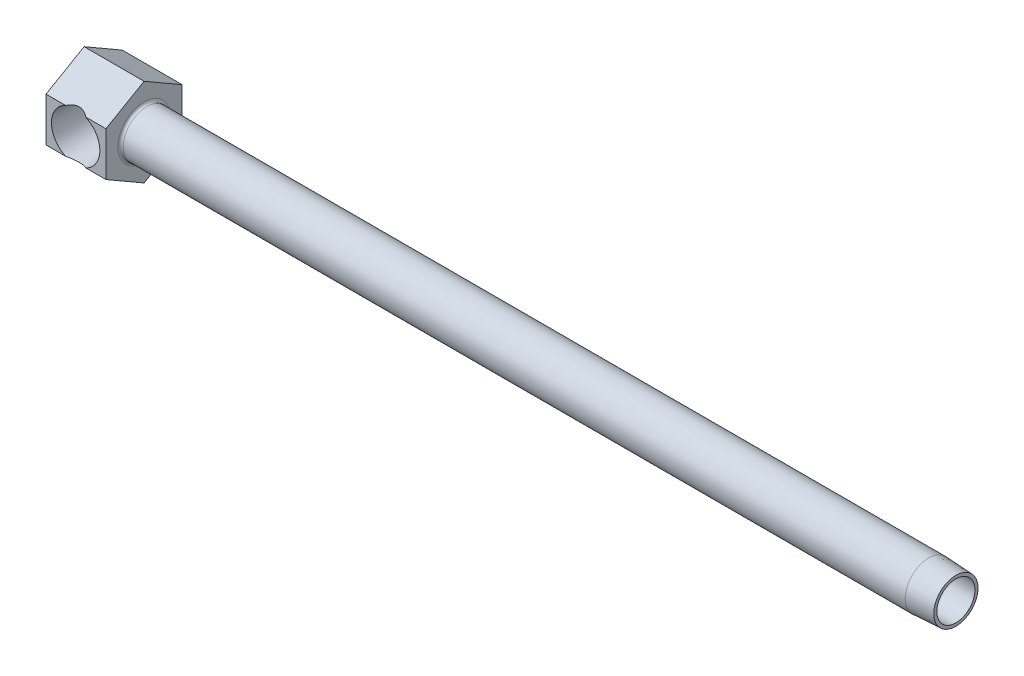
ISO-10303-21;
HEADER;
FILE_DESCRIPTION(('STEP AP214'),'2;1');
FILE_NAME('part.step','',(''),(''),'','','');
FILE_SCHEMA(('AUTOMOTIVE_DESIGN { 1 0 10303 214 1 1 1 1 }'));
ENDSEC;
DATA;
#1=APPLICATION_CONTEXT('core data for automotive mechanical design processes');
#2=APPLICATION_PROTOCOL_DEFINITION('international standard','automotive_design',2000,#1);
#3=PRODUCT_CONTEXT('',#1,'mechanical');
#4=PRODUCT('Part','Part','',(#3));
#5=PRODUCT_RELATED_PRODUCT_CATEGORY('part','',(#4));
#6=PRODUCT_DEFINITION_FORMATION('','',#4);
#7=PRODUCT_DEFINITION_CONTEXT('part definition',#1,'design');
#8=PRODUCT_DEFINITION('design','',#6,#7);
#9=PRODUCT_DEFINITION_SHAPE('','',#8);
#10=(LENGTH_UNIT() NAMED_UNIT(*) SI_UNIT(.MILLI.,.METRE.));
#11=(NAMED_UNIT(*) PLANE_ANGLE_UNIT() SI_UNIT($,.RADIAN.));
#12=(NAMED_UNIT(*) SI_UNIT($,.STERADIAN.) SOLID_ANGLE_UNIT());
#13=UNCERTAINTY_MEASURE_WITH_UNIT(LENGTH_MEASURE(1.E-05),#10,'distance_accuracy_value','');
#14=(GEOMETRIC_REPRESENTATION_CONTEXT(3) GLOBAL_UNCERTAINTY_ASSIGNED_CONTEXT((#13)) GLOBAL_UNIT_ASSIGNED_CONTEXT((#10,
#11,#12)) REPRESENTATION_CONTEXT('',''));
#15=CARTESIAN_POINT('',(0.,0.,0.));
#16=DIRECTION('',(0.,0.,1.));
#17=DIRECTION('',(1.,0.,0.));
#18=AXIS2_PLACEMENT_3D('',#15,#16,#17);
#19=CARTESIAN_POINT('',(63.5,0.,11.1125));
#20=DIRECTION('',(-1.,0.,0.));
#21=DIRECTION('',(0.,0.,1.));
#22=AXIS2_PLACEMENT_3D('',#19,#20,#21);
#23=CYLINDRICAL_SURFACE('',#22,6.858);
#24=CARTESIAN_POINT('',(18.2499,0.,11.1125));
#25=DIRECTION('',(-1.,0.,0.));
#26=DIRECTION('',(0.,-1.,0.));
#27=AXIS2_PLACEMENT_3D('',#24,#25,#26);
#28=CIRCLE('',#27,6.858);
#29=CARTESIAN_POINT('',(18.2499,-6.858,11.1125));
#30=VERTEX_POINT('',#29);
#31=EDGE_CURVE('E174',#30,#30,#28,.F.);
#32=ORIENTED_EDGE('',*,*,#31,.T.);
#33=EDGE_LOOP('',(#32));
#34=FACE_BOUND('',#33,.T.);
#35=CARTESIAN_POINT('',(246.0752,0.,11.1125));
#36=DIRECTION('',(1.,0.,0.));
#37=DIRECTION('',(0.,0.,-1.));
#38=AXIS2_PLACEMENT_3D('',#35,#36,#37);
#39=CIRCLE('',#38,6.858);
#40=CARTESIAN_POINT('',(246.0752,0.,4.2545));
#41=VERTEX_POINT('',#40);
#42=EDGE_CURVE('E218',#41,#41,#39,.T.);
#43=ORIENTED_EDGE('',*,*,#42,.F.);
#44=EDGE_LOOP('',(#43));
#45=FACE_BOUND('',#44,.T.);
#46=ADVANCED_FACE('F15',(#34,#45),#23,.T.);
#47=CARTESIAN_POINT('',(17.4625,6.4158048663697,22.225));
#48=DIRECTION('',(0.,0.,-1.));
#49=DIRECTION('',(0.,1.,0.));
#50=AXIS2_PLACEMENT_3D('',#47,#48,#49);
#51=PLANE('',#50);
#52=CARTESIAN_POINT('',(8.636,0.,22.225));
#53=DIRECTION('',(0.,0.,1.));
#54=DIRECTION('',(1.,0.,0.));
#55=AXIS2_PLACEMENT_3D('',#52,#53,#54);
#56=CIRCLE('',#55,7.05231);
#57=CARTESIAN_POINT('',(5.70811266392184,6.4158048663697,22.225));
#58=VERTEX_POINT('',#57);
#59=CARTESIAN_POINT('',(5.70811266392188,-6.41580486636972,22.225));
#60=VERTEX_POINT('',#59);
#61=EDGE_CURVE('E229',#58,#60,#56,.T.);
#62=ORIENTED_EDGE('',*,*,#61,.F.);
#63=DIRECTION('',(-1.,0.,0.));
#64=VECTOR('',#63,1.);
#65=CARTESIAN_POINT('',(17.4625,6.4158048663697,22.225));
#66=LINE('',#65,#64);
#67=CARTESIAN_POINT('',(0.,6.4158048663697,22.225));
#68=VERTEX_POINT('',#67);
#69=EDGE_CURVE('E158',#58,#68,#66,.T.);
#70=ORIENTED_EDGE('',*,*,#69,.T.);
#71=DIRECTION('',(0.,-1.,0.));
#72=VECTOR('',#71,1.);
#73=CARTESIAN_POINT('',(0.,6.4158048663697,22.225));
#74=LINE('',#73,#72);
#75=CARTESIAN_POINT('',(0.,-6.41580486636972,22.225));
#76=VERTEX_POINT('',#75);
#77=EDGE_CURVE('E128',#68,#76,#74,.T.);
#78=ORIENTED_EDGE('',*,*,#77,.T.);
#79=DIRECTION('',(-1.,0.,0.));
#80=VECTOR('',#79,1.);
#81=CARTESIAN_POINT('',(17.4625,-6.41580486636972,22.225));
#82=LINE('',#81,#80);
#83=EDGE_CURVE('E154',#60,#76,#82,.T.);
#84=ORIENTED_EDGE('',*,*,#83,.F.);
#85=EDGE_LOOP('',(#62,#70,#78,#84));
#86=FACE_BOUND('',#85,.T.);
#87=ADVANCED_FACE('F205',(#86),#51,.F.);
#88=CARTESIAN_POINT('',(11.5638873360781,-6.41580486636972,22.225));
#89=VERTEX_POINT('',#88);
#90=CARTESIAN_POINT('',(11.5638873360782,6.4158048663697,22.225));
#91=VERTEX_POINT('',#90);
#92=EDGE_CURVE('E228',#89,#91,#56,.T.);
#93=ORIENTED_EDGE('',*,*,#92,.F.);
#94=CARTESIAN_POINT('',(17.4625,-6.41580486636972,22.225));
#95=VERTEX_POINT('',#94);
#96=EDGE_CURVE('E155',#95,#89,#82,.T.);
#97=ORIENTED_EDGE('',*,*,#96,.F.);
#98=DIRECTION('',(0.,-1.,0.));
#99=VECTOR('',#98,1.);
#100=CARTESIAN_POINT('',(17.4625,6.4158048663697,22.225));
#101=LINE('',#100,#99);
#102=CARTESIAN_POINT('',(17.4625,6.4158048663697,22.225));
#103=VERTEX_POINT('',#102);
#104=EDGE_CURVE('E145',#103,#95,#101,.T.);
#105=ORIENTED_EDGE('',*,*,#104,.F.);
#106=EDGE_CURVE('E159',#103,#91,#66,.T.);
#107=ORIENTED_EDGE('',*,*,#106,.T.);
#108=EDGE_LOOP('',(#93,#97,#105,#107));
#109=FACE_BOUND('',#108,.T.);
#110=ADVANCED_FACE('F211',(#109),#51,.F.);
#111=CARTESIAN_POINT('',(17.4625,12.8316097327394,11.1125));
#112=DIRECTION('',(0.,-0.866025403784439,-0.5));
#113=DIRECTION('',(0.,0.5,-0.866025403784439));
#114=AXIS2_PLACEMENT_3D('',#111,#112,#113);
#115=PLANE('',#114);
#116=ORIENTED_EDGE('',*,*,#69,.F.);
#117=CARTESIAN_POINT('',(8.636,-0.384020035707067,34.002642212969));
#118=DIRECTION('',(0.,-0.866025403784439,-0.5));
#119=DIRECTION('',(0.,-0.5,0.866025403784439));
#120=AXIS2_PLACEMENT_3D('',#117,#118,#119);
#121=ELLIPSE('',#120,14.8098967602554,7.39498405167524);
#122=EDGE_CURVE('E109',#58,#91,#121,.T.);
#123=ORIENTED_EDGE('',*,*,#122,.T.);
#124=ORIENTED_EDGE('',*,*,#106,.F.);
#125=DIRECTION('',(0.,-0.5,0.866025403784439));
#126=VECTOR('',#125,1.);
#127=CARTESIAN_POINT('',(17.4625,12.8316097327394,11.1125));
#128=LINE('',#127,#126);
#129=CARTESIAN_POINT('',(17.4625,12.8316097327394,11.1125));
#130=VERTEX_POINT('',#129);
#131=EDGE_CURVE('E143',#130,#103,#128,.T.);
#132=ORIENTED_EDGE('',*,*,#131,.F.);
#133=DIRECTION('',(-1.,0.,0.));
#134=VECTOR('',#133,1.);
#135=CARTESIAN_POINT('',(17.4625,12.8316097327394,11.1125));
#136=LINE('',#135,#134);
#137=CARTESIAN_POINT('',(0.,12.8316097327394,11.1125));
#138=VERTEX_POINT('',#137);
#139=EDGE_CURVE('E162',#130,#138,#136,.T.);
#140=ORIENTED_EDGE('',*,*,#139,.T.);
#141=DIRECTION('',(0.,-0.5,0.866025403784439));
#142=VECTOR('',#141,1.);
#143=CARTESIAN_POINT('',(0.,12.8316097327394,11.1125));
#144=LINE('',#143,#142);
#145=EDGE_CURVE('E124',#138,#68,#144,.T.);
#146=ORIENTED_EDGE('',*,*,#145,.T.);
#147=EDGE_LOOP('',(#116,#123,#124,#132,#140,#146));
#148=FACE_BOUND('',#147,.T.);
#149=ADVANCED_FACE('F257',(#148),#115,.F.);
#150=CARTESIAN_POINT('',(17.4625,-6.41580486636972,22.225));
#151=DIRECTION('',(0.,0.866025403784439,-0.5));
#152=DIRECTION('',(0.,0.5,0.866025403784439));
#153=AXIS2_PLACEMENT_3D('',#150,#151,#152);
#154=PLANE('',#153);
#155=ORIENTED_EDGE('',*,*,#96,.T.);
#156=CARTESIAN_POINT('',(8.636,0.384020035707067,34.0026422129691));
#157=DIRECTION('',(0.,0.866025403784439,-0.5));
#158=DIRECTION('',(0.,0.5,0.866025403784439));
#159=AXIS2_PLACEMENT_3D('',#156,#157,#158);
#160=ELLIPSE('',#159,14.8098967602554,7.39498405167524);
#161=EDGE_CURVE('E34',#89,#60,#160,.T.);
#162=ORIENTED_EDGE('',*,*,#161,.T.);
#163=ORIENTED_EDGE('',*,*,#83,.T.);
#164=DIRECTION('',(0.,-0.5,-0.866025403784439));
#165=VECTOR('',#164,1.);
#166=CARTESIAN_POINT('',(0.,-6.41580486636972,22.225));
#167=LINE('',#166,#165);
#168=CARTESIAN_POINT('',(0.,-12.8316097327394,11.1125));
#169=VERTEX_POINT('',#168);
#170=EDGE_CURVE('E132',#76,#169,#167,.T.);
#171=ORIENTED_EDGE('',*,*,#170,.T.);
#172=DIRECTION('',(-1.,0.,0.));
#173=VECTOR('',#172,1.);
#174=CARTESIAN_POINT('',(17.4625,-12.8316097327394,11.1125));
#175=LINE('',#174,#173);
#176=CARTESIAN_POINT('',(17.4625,-12.8316097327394,11.1125));
#177=VERTEX_POINT('',#176);
#178=EDGE_CURVE('E149',#177,#169,#175,.T.);
#179=ORIENTED_EDGE('',*,*,#178,.F.);
#180=DIRECTION('',(0.,-0.5,-0.866025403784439));
#181=VECTOR('',#180,1.);
#182=CARTESIAN_POINT('',(17.4625,-6.41580486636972,22.225));
#183=LINE('',#182,#181);
#184=EDGE_CURVE('E147',#95,#177,#183,.T.);
#185=ORIENTED_EDGE('',*,*,#184,.F.);
#186=EDGE_LOOP('',(#155,#162,#163,#171,#179,#185));
#187=FACE_BOUND('',#186,.T.);
#188=ADVANCED_FACE('F235',(#187),#154,.F.);
#189=CARTESIAN_POINT('',(17.4625,-12.8316097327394,11.1125));
#190=DIRECTION('',(0.,0.866025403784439,0.5));
#191=DIRECTION('',(0.,-0.5,0.866025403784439));
#192=AXIS2_PLACEMENT_3D('',#189,#190,#191);
#193=PLANE('',#192);
#194=DIRECTION('',(0.,0.5,-0.866025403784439));
#195=VECTOR('',#194,1.);
#196=CARTESIAN_POINT('',(0.,-12.8316097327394,11.1125));
#197=LINE('',#196,#195);
#198=CARTESIAN_POINT('',(0.,-6.41580486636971,0.));
#199=VERTEX_POINT('',#198);
#200=EDGE_CURVE('E117',#169,#199,#197,.T.);
#201=ORIENTED_EDGE('',*,*,#200,.T.);
#202=DIRECTION('',(-1.,0.,0.));
#203=VECTOR('',#202,1.);
#204=CARTESIAN_POINT('',(17.4625,-6.41580486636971,0.));
#205=LINE('',#204,#203);
#206=CARTESIAN_POINT('',(17.4625,-6.41580486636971,0.));
#207=VERTEX_POINT('',#206);
#208=EDGE_CURVE('E168',#207,#199,#205,.T.);
#209=ORIENTED_EDGE('',*,*,#208,.F.);
#210=DIRECTION('',(0.,0.5,-0.866025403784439));
#211=VECTOR('',#210,1.);
#212=CARTESIAN_POINT('',(17.4625,-12.8316097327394,11.1125));
#213=LINE('',#212,#211);
#214=EDGE_CURVE('E135',#177,#207,#213,.T.);
#215=ORIENTED_EDGE('',*,*,#214,.F.);
#216=ORIENTED_EDGE('',*,*,#178,.T.);
#217=EDGE_LOOP('',(#201,#209,#215,#216));
#218=FACE_BOUND('',#217,.T.);
#219=ADVANCED_FACE('F247',(#218),#193,.F.);
#220=CARTESIAN_POINT('',(17.4625,-6.41580486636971,0.));
#221=DIRECTION('',(0.,0.,1.));
#222=DIRECTION('',(1.,0.,0.));
#223=AXIS2_PLACEMENT_3D('',#220,#221,#222);
#224=PLANE('',#223);
#225=DIRECTION('',(0.,1.,0.));
#226=VECTOR('',#225,1.);
#227=CARTESIAN_POINT('',(0.,-6.41580486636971,0.));
#228=LINE('',#227,#226);
#229=CARTESIAN_POINT('',(0.,6.41580486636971,0.));
#230=VERTEX_POINT('',#229);
#231=EDGE_CURVE('E118',#199,#230,#228,.T.);
#232=ORIENTED_EDGE('',*,*,#231,.T.);
#233=DIRECTION('',(-1.,0.,0.));
#234=VECTOR('',#233,1.);
#235=CARTESIAN_POINT('',(17.4625,6.41580486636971,0.));
#236=LINE('',#235,#234);
#237=CARTESIAN_POINT('',(17.4625,6.41580486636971,0.));
#238=VERTEX_POINT('',#237);
#239=EDGE_CURVE('E165',#238,#230,#236,.T.);
#240=ORIENTED_EDGE('',*,*,#239,.F.);
#241=DIRECTION('',(0.,1.,0.));
#242=VECTOR('',#241,1.);
#243=CARTESIAN_POINT('',(17.4625,-6.41580486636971,0.));
#244=LINE('',#243,#242);
#245=EDGE_CURVE('E139',#207,#238,#244,.T.);
#246=ORIENTED_EDGE('',*,*,#245,.F.);
#247=ORIENTED_EDGE('',*,*,#208,.T.);
#248=EDGE_LOOP('',(#232,#240,#246,#247));
#249=FACE_BOUND('',#248,.T.);
#250=ADVANCED_FACE('F264',(#249),#224,.F.);
#251=CARTESIAN_POINT('',(17.4625,6.4158048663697,0.));
#252=DIRECTION('',(0.,-0.866025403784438,0.5));
#253=DIRECTION('',(0.,-0.5,-0.866025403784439));
#254=AXIS2_PLACEMENT_3D('',#251,#252,#253);
#255=PLANE('',#254);
#256=DIRECTION('',(0.,0.5,0.866025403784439));
#257=VECTOR('',#256,1.);
#258=CARTESIAN_POINT('',(0.,6.4158048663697,0.));
#259=LINE('',#258,#257);
#260=EDGE_CURVE('E121',#230,#138,#259,.T.);
#261=ORIENTED_EDGE('',*,*,#260,.T.);
#262=ORIENTED_EDGE('',*,*,#139,.F.);
#263=DIRECTION('',(0.,0.5,0.866025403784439));
#264=VECTOR('',#263,1.);
#265=CARTESIAN_POINT('',(17.4625,6.4158048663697,0.));
#266=LINE('',#265,#264);
#267=EDGE_CURVE('E141',#238,#130,#266,.T.);
#268=ORIENTED_EDGE('',*,*,#267,.F.);
#269=ORIENTED_EDGE('',*,*,#239,.T.);
#270=EDGE_LOOP('',(#261,#262,#268,#269));
#271=FACE_BOUND('',#270,.T.);
#272=ADVANCED_FACE('F261',(#271),#255,.F.);
#273=CARTESIAN_POINT('',(17.4625,-19.2474145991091,22.225));
#274=DIRECTION('',(-1.,0.,0.));
#275=DIRECTION('',(0.,-1.,0.));
#276=AXIS2_PLACEMENT_3D('',#273,#274,#275);
#277=PLANE('',#276);
#278=CARTESIAN_POINT('',(17.4625,0.,11.1125));
#279=DIRECTION('',(-1.,0.,0.));
#280=DIRECTION('',(0.,-1.,0.));
#281=AXIS2_PLACEMENT_3D('',#278,#279,#280);
#282=CIRCLE('',#281,7.6454);
#283=CARTESIAN_POINT('',(17.4625,-7.6454,11.1125));
#284=VERTEX_POINT('',#283);
#285=EDGE_CURVE('E171',#284,#284,#282,.T.);
#286=ORIENTED_EDGE('',*,*,#285,.T.);
#287=EDGE_LOOP('',(#286));
#288=FACE_BOUND('',#287,.T.);
#289=ORIENTED_EDGE('',*,*,#214,.T.);
#290=ORIENTED_EDGE('',*,*,#245,.T.);
#291=ORIENTED_EDGE('',*,*,#267,.T.);
#292=ORIENTED_EDGE('',*,*,#131,.T.);
#293=ORIENTED_EDGE('',*,*,#104,.T.);
#294=ORIENTED_EDGE('',*,*,#184,.T.);
#295=EDGE_LOOP('',(#289,#290,#291,#292,#293,#294));
#296=FACE_BOUND('',#295,.T.);
#297=ADVANCED_FACE('F250',(#288,#296),#277,.F.);
#298=CARTESIAN_POINT('',(0.,-19.2474145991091,22.225));
#299=DIRECTION('',(-1.,0.,0.));
#300=DIRECTION('',(0.,-1.,0.));
#301=AXIS2_PLACEMENT_3D('',#298,#299,#300);
#302=PLANE('',#301);
#303=ORIENTED_EDGE('',*,*,#200,.F.);
#304=ORIENTED_EDGE('',*,*,#170,.F.);
#305=ORIENTED_EDGE('',*,*,#77,.F.);
#306=ORIENTED_EDGE('',*,*,#145,.F.);
#307=ORIENTED_EDGE('',*,*,#260,.F.);
#308=ORIENTED_EDGE('',*,*,#231,.F.);
#309=EDGE_LOOP('',(#303,#304,#305,#306,#307,#308));
#310=FACE_BOUND('',#309,.T.);
#311=ADVANCED_FACE('F243',(#310),#302,.T.);
#312=CARTESIAN_POINT('',(18.2499,0.,11.1125));
#313=DIRECTION('',(-1.,0.,0.));
#314=DIRECTION('',(0.,-1.,0.));
#315=AXIS2_PLACEMENT_3D('',#312,#313,#314);
#316=TOROIDAL_SURFACE('',#315,7.6454,0.7874);
#317=ORIENTED_EDGE('',*,*,#31,.F.);
#318=EDGE_LOOP('',(#317));
#319=FACE_BOUND('',#318,.T.);
#320=ORIENTED_EDGE('',*,*,#285,.F.);
#321=EDGE_LOOP('',(#320));
#322=FACE_BOUND('',#321,.T.);
#323=ADVANCED_FACE('F282',(#319,#322),#316,.F.);
#324=CARTESIAN_POINT('',(63.5,0.,11.1125));
#325=DIRECTION('',(1.,0.,0.));
#326=DIRECTION('',(0.,0.,-1.));
#327=AXIS2_PLACEMENT_3D('',#324,#325,#326);
#328=CYLINDRICAL_SURFACE('',#327,5.5499);
#329=DIRECTION('',(1.,0.,0.));
#330=VECTOR('',#329,1.);
#331=CARTESIAN_POINT('',(63.5,1.29165930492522,5.715));
#332=LINE('',#331,#330);
#333=CARTESIAN_POINT('',(15.0655177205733,1.29165930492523,5.715));
#334=VERTEX_POINT('',#333);
#335=CARTESIAN_POINT('',(14.0465577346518,1.29165930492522,5.715));
#336=VERTEX_POINT('',#335);
#337=EDGE_CURVE('E27',#334,#336,#332,.F.);
#338=ORIENTED_EDGE('',*,*,#337,.T.);
#339=CARTESIAN_POINT('',(14.0465577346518,1.29165930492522,5.715));
#340=CARTESIAN_POINT('',(14.0725617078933,1.1828202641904,5.68893317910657));
#341=CARTESIAN_POINT('',(14.0954190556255,1.0724477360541,5.66602138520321));
#342=CARTESIAN_POINT('',(14.1345363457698,0.849345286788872,5.62681178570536));
#343=CARTESIAN_POINT('',(14.1507939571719,0.736614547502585,5.61051631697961));
#344=CARTESIAN_POINT('',(14.1760383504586,0.512691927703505,5.58521342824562));
#345=CARTESIAN_POINT('',(14.1852120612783,0.401542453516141,5.57601863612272));
#346=CARTESIAN_POINT('',(14.1968530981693,0.17856718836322,5.56435088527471));
#347=CARTESIAN_POINT('',(14.1993222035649,0.0667415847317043,5.56187614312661));
#348=CARTESIAN_POINT('',(14.1975723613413,-0.14949882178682,5.56362999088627));
#349=CARTESIAN_POINT('',(14.193779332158,-0.253921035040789,5.56743168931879));
#350=CARTESIAN_POINT('',(14.1803598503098,-0.462026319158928,5.58088200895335));
#351=CARTESIAN_POINT('',(14.1707325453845,-0.565709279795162,5.59053148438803));
#352=CARTESIAN_POINT('',(14.1454600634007,-0.774399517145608,5.61586264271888));
#353=CARTESIAN_POINT('',(14.12966315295,-0.87936981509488,5.63169642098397));
#354=CARTESIAN_POINT('',(14.092340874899,-1.08722287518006,5.6691068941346));
#355=CARTESIAN_POINT('',(14.0708169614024,-1.1901061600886,5.69068213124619));
#356=CARTESIAN_POINT('',(14.0465577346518,-1.29165930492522,5.715));
#357=B_SPLINE_CURVE_WITH_KNOTS('',3,(#339,#340,#341,#342,#343,#344,#345,#346,#347,#348,#349,
#350,#351,#352,#353,#354,#355,#356),.UNSPECIFIED.,.F.,.F.,(4,2,2,2,2,2,2,2,4),(0.,
0.344637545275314,0.689396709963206,1.02471413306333,1.35994255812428,1.67329546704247,
1.98669416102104,2.30834220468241,2.62990865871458),.UNSPECIFIED.);
#358=CARTESIAN_POINT('',(14.0465577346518,-1.29165930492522,5.715));
#359=VERTEX_POINT('',#358);
#360=EDGE_CURVE('E10',#336,#359,#357,.T.);
#361=ORIENTED_EDGE('',*,*,#360,.T.);
#362=DIRECTION('',(1.,0.,0.));
#363=VECTOR('',#362,1.);
#364=CARTESIAN_POINT('',(63.5,-1.29165930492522,5.715));
#365=LINE('',#364,#363);
#366=CARTESIAN_POINT('',(15.0655177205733,-1.29165930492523,5.715));
#367=VERTEX_POINT('',#366);
#368=EDGE_CURVE('E184',#359,#367,#365,.T.);
#369=ORIENTED_EDGE('',*,*,#368,.T.);
#370=CARTESIAN_POINT('',(15.0656795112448,-1.29082327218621,5.71480000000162));
#371=CARTESIAN_POINT('',(15.0372536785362,-1.43791824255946,5.7499521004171));
#372=CARTESIAN_POINT('',(15.0041876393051,-1.58262926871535,5.79093746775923));
#373=CARTESIAN_POINT('',(14.9298152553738,-1.86616189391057,5.88364074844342));
#374=CARTESIAN_POINT('',(14.8885204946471,-2.00499144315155,5.93534357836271));
#375=CARTESIAN_POINT('',(14.7990709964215,-2.27477346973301,6.0481148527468));
#376=CARTESIAN_POINT('',(14.7509848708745,-2.40578805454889,6.10909004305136));
#377=CARTESIAN_POINT('',(14.6486806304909,-2.66083130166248,6.2399326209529));
#378=CARTESIAN_POINT('',(14.5944604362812,-2.78485757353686,6.30980302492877));
#379=CARTESIAN_POINT('',(14.4812536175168,-3.02482355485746,6.4572285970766));
#380=CARTESIAN_POINT('',(14.4222960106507,-3.1408054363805,6.53473755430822));
#381=CARTESIAN_POINT('',(14.3003856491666,-3.365215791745,6.6970845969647));
#382=CARTESIAN_POINT('',(14.2374332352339,-3.47364490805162,6.78192205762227));
#383=CARTESIAN_POINT('',(14.0435453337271,-3.78827180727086,7.04729631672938));
#384=CARTESIAN_POINT('',(13.9079456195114,-3.9830565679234,7.23822682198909));
#385=CARTESIAN_POINT('',(13.689310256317,-4.26816238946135,7.56146618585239));
#386=CARTESIAN_POINT('',(13.6074310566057,-4.3686517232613,7.68585924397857));
#387=CARTESIAN_POINT('',(13.4442899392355,-4.55879004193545,7.94320688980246));
#388=CARTESIAN_POINT('',(13.3630282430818,-4.6484352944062,8.07616440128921));
#389=CARTESIAN_POINT('',(13.2036424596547,-4.81645966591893,8.35044586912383));
#390=CARTESIAN_POINT('',(13.1255135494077,-4.89485662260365,8.49175606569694));
#391=CARTESIAN_POINT('',(12.9752684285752,-5.04004510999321,8.78316437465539));
#392=CARTESIAN_POINT('',(12.9031480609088,-5.10684469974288,8.93325628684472));
#393=CARTESIAN_POINT('',(12.757824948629,-5.23785122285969,9.26762207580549));
#394=CARTESIAN_POINT('',(12.686320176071,-5.29990617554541,9.45350692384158));
#395=CARTESIAN_POINT('',(12.5645322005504,-5.40502712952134,9.83721903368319));
#396=CARTESIAN_POINT('',(12.5142004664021,-5.44813656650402,10.035017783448));
#397=CARTESIAN_POINT('',(12.4606756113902,-5.49679755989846,10.3395644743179));
#398=CARTESIAN_POINT('',(12.4464754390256,-5.51038902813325,10.443158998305));
#399=CARTESIAN_POINT('',(12.4264834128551,-5.5317354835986,10.6517762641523));
#400=CARTESIAN_POINT('',(12.4206908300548,-5.53949097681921,10.7567988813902));
#401=CARTESIAN_POINT('',(12.4179376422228,-5.54899639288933,10.9671942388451));
#402=CARTESIAN_POINT('',(12.4209736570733,-5.55074861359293,11.0725668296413));
#403=CARTESIAN_POINT('',(12.4357182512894,-5.54828805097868,11.2826067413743));
#404=CARTESIAN_POINT('',(12.4474268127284,-5.54407527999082,11.3872740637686));
#405=CARTESIAN_POINT('',(12.4900727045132,-5.52483789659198,11.6684350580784));
#406=CARTESIAN_POINT('',(12.5287513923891,-5.5042766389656,11.8434168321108));
#407=CARTESIAN_POINT('',(12.6245766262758,-5.44793106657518,12.1856637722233));
#408=CARTESIAN_POINT('',(12.6817493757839,-5.41212512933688,12.3529176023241));
#409=CARTESIAN_POINT('',(12.8020710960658,-5.33165221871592,12.6608364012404));
#410=CARTESIAN_POINT('',(12.8638814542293,-5.28838367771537,12.8024081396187));
#411=CARTESIAN_POINT('',(12.9946271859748,-5.19196308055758,13.0788046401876));
#412=CARTESIAN_POINT('',(13.0635675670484,-5.13880405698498,13.2136245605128));
#413=CARTESIAN_POINT('',(13.2061680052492,-5.0230773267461,13.476991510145));
#414=CARTESIAN_POINT('',(13.2798387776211,-4.96048779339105,13.6055230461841));
#415=CARTESIAN_POINT('',(13.4297455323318,-4.82635797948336,13.8561944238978));
#416=CARTESIAN_POINT('',(13.505980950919,-4.75481965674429,13.9783356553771));
#417=CARTESIAN_POINT('',(13.664111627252,-4.59832635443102,14.2236446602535));
#418=CARTESIAN_POINT('',(13.7460684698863,-4.51281916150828,14.3464205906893));
#419=CARTESIAN_POINT('',(13.9094765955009,-4.33199713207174,14.5849036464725));
#420=CARTESIAN_POINT('',(13.9909278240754,-4.23668125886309,14.7006100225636));
#421=CARTESIAN_POINT('',(14.1517819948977,-4.03638256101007,14.9245234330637));
#422=CARTESIAN_POINT('',(14.231187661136,-3.93141354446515,15.0327408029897));
#423=CARTESIAN_POINT('',(14.3867175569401,-3.71172769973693,15.2413555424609));
#424=CARTESIAN_POINT('',(14.4628409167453,-3.59700831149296,15.3417508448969));
#425=CARTESIAN_POINT('',(14.668135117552,-3.26437402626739,15.6091426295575));
#426=CARTESIAN_POINT('',(14.7924014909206,-3.03572507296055,15.7670513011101));
#427=CARTESIAN_POINT('',(14.961823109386,-2.67104021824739,15.9794040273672));
#428=CARTESIAN_POINT('',(15.0154673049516,-2.54586009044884,16.0461031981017));
#429=CARTESIAN_POINT('',(15.1161712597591,-2.28856209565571,16.1705894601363));
#430=CARTESIAN_POINT('',(15.1632322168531,-2.15644549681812,16.2283781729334));
#431=CARTESIAN_POINT('',(15.2428146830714,-1.9076542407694,16.3256678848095));
#432=CARTESIAN_POINT('',(15.2764575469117,-1.79190088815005,16.3666154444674));
#433=CARTESIAN_POINT('',(15.3378292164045,-1.55651069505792,16.4410921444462));
#434=CARTESIAN_POINT('',(15.3655591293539,-1.43687458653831,16.4746226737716));
#435=CARTESIAN_POINT('',(15.4145953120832,-1.19439983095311,16.5337884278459));
#436=CARTESIAN_POINT('',(15.4359031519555,-1.0715619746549,16.5594255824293));
#437=CARTESIAN_POINT('',(15.4716760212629,-0.823504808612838,16.6024058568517));
#438=CARTESIAN_POINT('',(15.4861437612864,-0.698286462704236,16.6197522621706));
#439=CARTESIAN_POINT('',(15.5079865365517,-0.445852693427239,16.645922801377));
#440=CARTESIAN_POINT('',(15.5153340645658,-0.318631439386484,16.6547138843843));
#441=CARTESIAN_POINT('',(15.522677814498,-0.063671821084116,16.6635004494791));
#442=CARTESIAN_POINT('',(15.5226740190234,0.0640665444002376,16.6634959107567));
#443=CARTESIAN_POINT('',(15.5153149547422,0.319031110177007,16.6546910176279));
#444=CARTESIAN_POINT('',(15.5079593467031,0.446257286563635,16.64589025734));
#445=CARTESIAN_POINT('',(15.4860583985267,0.699182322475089,16.6196499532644));
#446=CARTESIAN_POINT('',(15.4715132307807,0.824881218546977,16.6022106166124));
#447=CARTESIAN_POINT('',(15.4365532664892,1.06681669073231,16.5602063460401));
#448=CARTESIAN_POINT('',(15.4165150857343,1.18318753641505,16.5360979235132));
#449=CARTESIAN_POINT('',(15.370668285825,1.41308832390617,16.4807930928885));
#450=CARTESIAN_POINT('',(15.3448577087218,1.52661728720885,16.4495942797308));
#451=CARTESIAN_POINT('',(15.2593968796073,1.8619852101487,16.3459550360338));
#452=CARTESIAN_POINT('',(15.1916934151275,2.07876635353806,16.2634431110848));
#453=CARTESIAN_POINT('',(15.0313088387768,2.51543897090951,16.0659794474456));
#454=CARTESIAN_POINT('',(14.9368359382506,2.73357267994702,15.9486491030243));
#455=CARTESIAN_POINT('',(14.7321201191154,3.14711164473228,15.6903358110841));
#456=CARTESIAN_POINT('',(14.6218705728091,3.34250728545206,15.549342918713));
#457=CARTESIAN_POINT('',(14.3660176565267,3.74896640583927,15.2149275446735));
#458=CARTESIAN_POINT('',(14.217881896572,3.95452519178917,15.0167316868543));
#459=CARTESIAN_POINT('',(13.9905991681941,4.23685264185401,14.7000501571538));
#460=CARTESIAN_POINT('',(13.9138995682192,4.32671599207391,14.5911203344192));
#461=CARTESIAN_POINT('',(13.7600052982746,4.49774000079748,14.366972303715));
#462=CARTESIAN_POINT('',(13.682810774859,4.57890311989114,14.2517558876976));
#463=CARTESIAN_POINT('',(13.5283146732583,4.73340315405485,14.0136509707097));
#464=CARTESIAN_POINT('',(13.4510233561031,4.80663208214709,13.8906858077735));
#465=CARTESIAN_POINT('',(13.2989020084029,4.94395744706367,13.6382338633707));
#466=CARTESIAN_POINT('',(13.2240725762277,5.00805167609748,13.5087455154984));
#467=CARTESIAN_POINT('',(13.0790371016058,5.12664196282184,13.2432341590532));
#468=CARTESIAN_POINT('',(13.0088235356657,5.18115389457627,13.107222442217));
#469=CARTESIAN_POINT('',(12.8755190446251,5.28008101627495,12.8283198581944));
#470=CARTESIAN_POINT('',(12.8124234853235,5.3245027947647,12.6854335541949));
#471=CARTESIAN_POINT('',(12.6833891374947,5.4112685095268,12.3591277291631));
#472=CARTESIAN_POINT('',(12.6200540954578,5.45085356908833,12.1738679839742));
#473=CARTESIAN_POINT('',(12.5423523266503,5.49611259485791,11.8892630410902));
#474=CARTESIAN_POINT('',(12.5193453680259,5.50884182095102,11.7933456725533));
#475=CARTESIAN_POINT('',(12.4799604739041,5.52933440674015,11.5996550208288));
#476=CARTESIAN_POINT('',(12.4635791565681,5.53710030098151,11.5018827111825));
#477=CARTESIAN_POINT('',(12.4380468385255,5.54748556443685,11.3040796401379));
#478=CARTESIAN_POINT('',(12.4289726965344,5.55005064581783,11.2040359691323));
#479=CARTESIAN_POINT('',(12.418786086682,5.54973569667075,11.0035516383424));
#480=CARTESIAN_POINT('',(12.4176731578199,5.54685598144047,10.9031110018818));
#481=CARTESIAN_POINT('',(12.4234254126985,5.53566138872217,10.7027211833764));
#482=CARTESIAN_POINT('',(12.4302942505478,5.52734402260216,10.6027722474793));
#483=CARTESIAN_POINT('',(12.4515981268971,5.5054275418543,10.4042328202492));
#484=CARTESIAN_POINT('',(12.4660373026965,5.4918255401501,10.3056431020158));
#485=CARTESIAN_POINT('',(12.5044721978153,5.45712893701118,10.0955734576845));
#486=CARTESIAN_POINT('',(12.5295946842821,5.43520467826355,9.98443807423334));
#487=CARTESIAN_POINT('',(12.5874763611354,5.38514310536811,9.76556012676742));
#488=CARTESIAN_POINT('',(12.6202414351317,5.35700100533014,9.65782024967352));
#489=CARTESIAN_POINT('',(12.6919869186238,5.29489520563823,9.44585515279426));
#490=CARTESIAN_POINT('',(12.7309829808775,5.2609168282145,9.34163960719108));
#491=CARTESIAN_POINT('',(12.813732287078,5.18758941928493,9.13712531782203));
#492=CARTESIAN_POINT('',(12.8574843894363,5.14824167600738,9.03682564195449));
#493=CARTESIAN_POINT('',(12.9739768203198,5.04107082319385,8.78510193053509));
#494=CARTESIAN_POINT('',(13.0492646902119,4.96961386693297,8.63639571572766));
#495=CARTESIAN_POINT('',(13.2048344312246,4.81508369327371,8.34787401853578));
#496=CARTESIAN_POINT('',(13.2851189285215,4.73200433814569,8.20806329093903));
#497=CARTESIAN_POINT('',(13.4480056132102,4.55446924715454,7.93688996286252));
#498=CARTESIAN_POINT('',(13.5306114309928,4.45999483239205,7.80554179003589));
#499=CARTESIAN_POINT('',(13.6957298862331,4.25996324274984,7.55156980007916));
#500=CARTESIAN_POINT('',(13.7782425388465,4.15440825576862,7.42894426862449));
#501=CARTESIAN_POINT('',(13.9441031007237,3.92836612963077,7.18853642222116));
#502=CARTESIAN_POINT('',(14.0273794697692,3.80748613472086,7.0710730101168));
#503=CARTESIAN_POINT('',(14.1898135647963,3.55392137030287,6.84638586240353));
#504=CARTESIAN_POINT('',(14.2689704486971,3.42123420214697,6.73916421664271));
#505=CARTESIAN_POINT('',(14.420885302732,3.14485348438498,6.53641941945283));
#506=CARTESIAN_POINT('',(14.4936705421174,3.0012123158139,6.44084565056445));
#507=CARTESIAN_POINT('',(14.6312840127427,2.70291662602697,6.2621549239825));
#508=CARTESIAN_POINT('',(14.6961173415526,2.54826926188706,6.17902997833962));
#509=CARTESIAN_POINT('',(14.8204425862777,2.21665612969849,6.02094073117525));
#510=CARTESIAN_POINT('',(14.8791782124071,2.03888590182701,5.94704372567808));
#511=CARTESIAN_POINT('',(14.957111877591,1.76426185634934,5.84958505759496));
#512=CARTESIAN_POINT('',(14.9814347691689,1.67119024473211,5.81928093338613));
#513=CARTESIAN_POINT('',(15.0263924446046,1.48269404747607,5.76341790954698));
#514=CARTESIAN_POINT('',(15.047024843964,1.38726798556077,5.73786207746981));
#515=CARTESIAN_POINT('',(15.0656795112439,1.2908232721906,5.71480000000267));
#516=B_SPLINE_CURVE_WITH_KNOTS('',3,(#370,#371,#372,#373,#374,#375,#376,#377,#378,#379,#380,
#381,#382,#383,#384,#385,#386,#387,#388,#389,#390,#391,#392,#393,#394,#395,#396,#397,#398,#399,
#400,#401,#402,#403,#404,#405,#406,#407,#408,#409,#410,#411,#412,#413,#414,#415,#416,#417,#418,
#419,#420,#421,#422,#423,#424,#425,#426,#427,#428,#429,#430,#431,#432,#433,#434,#435,#436,#437,
#438,#439,#440,#441,#442,#443,#444,#445,#446,#447,#448,#449,#450,#451,#452,#453,#454,#455,#456,
#457,#458,#459,#460,#461,#462,#463,#464,#465,#466,#467,#468,#469,#470,#471,#472,#473,#474,#475,
#476,#477,#478,#479,#480,#481,#482,#483,#484,#485,#486,#487,#488,#489,#490,#491,#492,#493,#494,
#495,#496,#497,#498,#499,#500,#501,#502,#503,#504,#505,#506,#507,#508,#509,#510,#511,#512,#513,
#514,#515),.UNSPECIFIED.,.F.,.F.,(4,2,2,2,2,2,2,2,2,2,2,2,2,2,2,2,2,2,2,2,2,2,2,2,2,2,2,2,2,2,2,
2,2,2,2,2,2,2,2,2,2,2,2,2,2,2,2,2,2,2,2,2,2,2,2,2,2,2,2,2,2,2,2,2,2,2,2,2,2,2,2,2,4),(0.,
0.461329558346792,0.922014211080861,1.37833951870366,1.83481998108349,2.2886910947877,
2.74252355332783,3.65304009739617,4.19159436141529,4.73033346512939,5.26820855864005,
5.80570837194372,6.42981366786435,7.05248053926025,7.36837231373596,7.68423669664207,
7.99998016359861,8.31572297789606,8.85459341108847,9.39423071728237,9.87481564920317,
10.3557404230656,10.837795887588,11.3197460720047,11.8310943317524,12.3424966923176,
12.8531785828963,13.3639949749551,14.2729996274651,14.7275015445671,15.1819206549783,
15.5634665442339,15.9449409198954,16.3263219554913,16.707551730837,17.0902484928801,
17.472946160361,17.8556614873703,18.2383676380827,18.5995247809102,18.9608046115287,
19.682873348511,20.4753483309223,21.2681572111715,22.2295647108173,22.7113905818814,
23.1930798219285,23.6806666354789,24.1683710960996,24.6552598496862,25.1418297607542,
25.7388115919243,26.0368814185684,26.3347989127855,26.6358104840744,26.9368046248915,
27.237936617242,27.5392333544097,27.8867825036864,28.2346001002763,28.5833055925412,
28.9319275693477,29.4751694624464,30.0186993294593,30.5631325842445,31.1074585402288,
31.6708023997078,32.2342609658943,32.7951763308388,33.3557302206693,33.9579898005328,
34.2603814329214,34.5629677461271),.UNSPECIFIED.);
#517=EDGE_CURVE('E177',#367,#334,#516,.T.);
#518=ORIENTED_EDGE('',*,*,#517,.T.);
#519=EDGE_LOOP('',(#338,#361,#369,#518));
#520=FACE_BOUND('',#519,.T.);
#521=CARTESIAN_POINT('',(254.,0.,11.1125));
#522=DIRECTION('',(1.,0.,0.));
#523=DIRECTION('',(0.,0.,-1.));
#524=AXIS2_PLACEMENT_3D('',#521,#522,#523);
#525=CIRCLE('',#524,5.5499);
#526=CARTESIAN_POINT('',(254.,0.,5.5626));
#527=VERTEX_POINT('',#526);
#528=EDGE_CURVE('E223',#527,#527,#525,.T.);
#529=ORIENTED_EDGE('',*,*,#528,.T.);
#530=EDGE_LOOP('',(#529));
#531=FACE_BOUND('',#530,.T.);
#532=ADVANCED_FACE('F185',(#520,#531),#328,.F.);
#533=CARTESIAN_POINT('',(14.1986,0.,5.715));
#534=DIRECTION('',(0.,0.,-1.));
#535=DIRECTION('',(-1.,0.,0.));
#536=AXIS2_PLACEMENT_3D('',#533,#534,#535);
#537=PLANE('',#536);
#538=CARTESIAN_POINT('',(8.636,0.,5.715));
#539=DIRECTION('',(0.,0.,1.));
#540=DIRECTION('',(1.,0.,0.));
#541=AXIS2_PLACEMENT_3D('',#538,#539,#540);
#542=CIRCLE('',#541,6.55797849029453);
#543=EDGE_CURVE('E41',#334,#367,#542,.T.);
#544=ORIENTED_EDGE('',*,*,#543,.T.);
#545=ORIENTED_EDGE('',*,*,#368,.F.);
#546=CARTESIAN_POINT('',(8.636,0.,5.715));
#547=DIRECTION('',(0.,0.,1.));
#548=DIRECTION('',(1.,0.,0.));
#549=AXIS2_PLACEMENT_3D('',#546,#547,#548);
#550=CIRCLE('',#549,5.5626);
#551=EDGE_CURVE('E107',#336,#359,#550,.T.);
#552=ORIENTED_EDGE('',*,*,#551,.F.);
#553=ORIENTED_EDGE('',*,*,#337,.F.);
#554=EDGE_LOOP('',(#544,#545,#552,#553));
#555=FACE_BOUND('',#554,.T.);
#556=ADVANCED_FACE('F194',(#555),#537,.F.);
#557=CARTESIAN_POINT('',(8.636,0.,22.225));
#558=DIRECTION('',(0.,0.,1.));
#559=DIRECTION('',(1.,0.,0.));
#560=AXIS2_PLACEMENT_3D('',#557,#558,#559);
#561=CYLINDRICAL_SURFACE('',#560,5.5626);
#562=CARTESIAN_POINT('',(8.636,0.,4.445));
#563=DIRECTION('',(0.,0.,1.));
#564=DIRECTION('',(1.,0.,0.));
#565=AXIS2_PLACEMENT_3D('',#562,#563,#564);
#566=CIRCLE('',#565,5.5626);
#567=CARTESIAN_POINT('',(14.1986,0.,4.445));
#568=VERTEX_POINT('',#567);
#569=EDGE_CURVE('E105',#568,#568,#566,.T.);
#570=ORIENTED_EDGE('',*,*,#569,.F.);
#571=EDGE_LOOP('',(#570));
#572=FACE_BOUND('',#571,.T.);
#573=ORIENTED_EDGE('',*,*,#551,.T.);
#574=ORIENTED_EDGE('',*,*,#360,.F.);
#575=EDGE_LOOP('',(#573,#574));
#576=FACE_BOUND('',#575,.T.);
#577=ADVANCED_FACE('F192',(#572,#576),#561,.F.);
#578=CARTESIAN_POINT('',(8.636,0.,22.225));
#579=DIRECTION('',(0.,0.,1.));
#580=DIRECTION('',(1.,0.,0.));
#581=AXIS2_PLACEMENT_3D('',#578,#579,#580);
#582=CONICAL_SURFACE('',#581,7.05231,0.0299323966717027);
#583=ORIENTED_EDGE('',*,*,#543,.F.);
#584=ORIENTED_EDGE('',*,*,#517,.F.);
#585=EDGE_LOOP('',(#583,#584));
#586=FACE_BOUND('',#585,.T.);
#587=ORIENTED_EDGE('',*,*,#61,.T.);
#588=ORIENTED_EDGE('',*,*,#161,.F.);
#589=ORIENTED_EDGE('',*,*,#92,.T.);
#590=ORIENTED_EDGE('',*,*,#122,.F.);
#591=EDGE_LOOP('',(#587,#588,#589,#590));
#592=FACE_BOUND('',#591,.T.);
#593=ADVANCED_FACE('F101',(#586,#592),#582,.F.);
#594=CARTESIAN_POINT('',(8.636,0.,4.445));
#595=DIRECTION('',(0.,0.,1.));
#596=DIRECTION('',(1.,0.,0.));
#597=AXIS2_PLACEMENT_3D('',#594,#595,#596);
#598=CONICAL_SURFACE('',#597,5.5626,1.02974425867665);
#599=CARTESIAN_POINT('',(8.636,0.,1.10265272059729));
#600=VERTEX_POINT('',#599);
#601=VERTEX_LOOP('',#600);
#602=FACE_BOUND('',#601,.T.);
#603=ORIENTED_EDGE('',*,*,#569,.T.);
#604=EDGE_LOOP('',(#603));
#605=FACE_BOUND('',#604,.T.);
#606=ADVANCED_FACE('F97',(#602,#605),#598,.F.);
#607=CARTESIAN_POINT('',(254.,0.,5.5626));
#608=DIRECTION('',(1.,0.,0.));
#609=DIRECTION('',(0.,0.,-1.));
#610=AXIS2_PLACEMENT_3D('',#607,#608,#609);
#611=PLANE('',#610);
#612=CARTESIAN_POINT('',(254.,0.,11.1125));
#613=DIRECTION('',(1.,0.,0.));
#614=DIRECTION('',(0.,0.,-1.));
#615=AXIS2_PLACEMENT_3D('',#612,#613,#614);
#616=CIRCLE('',#615,6.44267883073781);
#617=CARTESIAN_POINT('',(254.,0.,4.66982116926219));
#618=VERTEX_POINT('',#617);
#619=EDGE_CURVE('E220',#618,#618,#616,.T.);
#620=ORIENTED_EDGE('',*,*,#619,.T.);
#621=EDGE_LOOP('',(#620));
#622=FACE_BOUND('',#621,.T.);
#623=ORIENTED_EDGE('',*,*,#528,.F.);
#624=EDGE_LOOP('',(#623));
#625=FACE_BOUND('',#624,.T.);
#626=ADVANCED_FACE('F100',(#622,#625),#611,.T.);
#627=CARTESIAN_POINT('',(254.,0.,11.1125));
#628=DIRECTION('',(-1.,0.,0.));
#629=DIRECTION('',(0.,0.,1.));
#630=AXIS2_PLACEMENT_3D('',#627,#628,#629);
#631=CONICAL_SURFACE('',#630,6.44267883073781,0.052359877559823);
#632=ORIENTED_EDGE('',*,*,#42,.T.);
#633=EDGE_LOOP('',(#632));
#634=FACE_BOUND('',#633,.T.);
#635=ORIENTED_EDGE('',*,*,#619,.F.);
#636=EDGE_LOOP('',(#635));
#637=FACE_BOUND('',#636,.T.);
#638=ADVANCED_FACE('F300',(#634,#637),#631,.T.);
#639=CLOSED_SHELL('',(#46,#87,#110,#149,#188,#219,#250,#272,#297,#311,#323,#532,#556,#577,#593,
#606,#626,#638));
#640=MANIFOLD_SOLID_BREP('B1',#639);
#641=ADVANCED_BREP_SHAPE_REPRESENTATION('',(#18,#640),#14);
#642=SHAPE_DEFINITION_REPRESENTATION(#9,#641);
ENDSEC;
END-ISO-10303-21;
